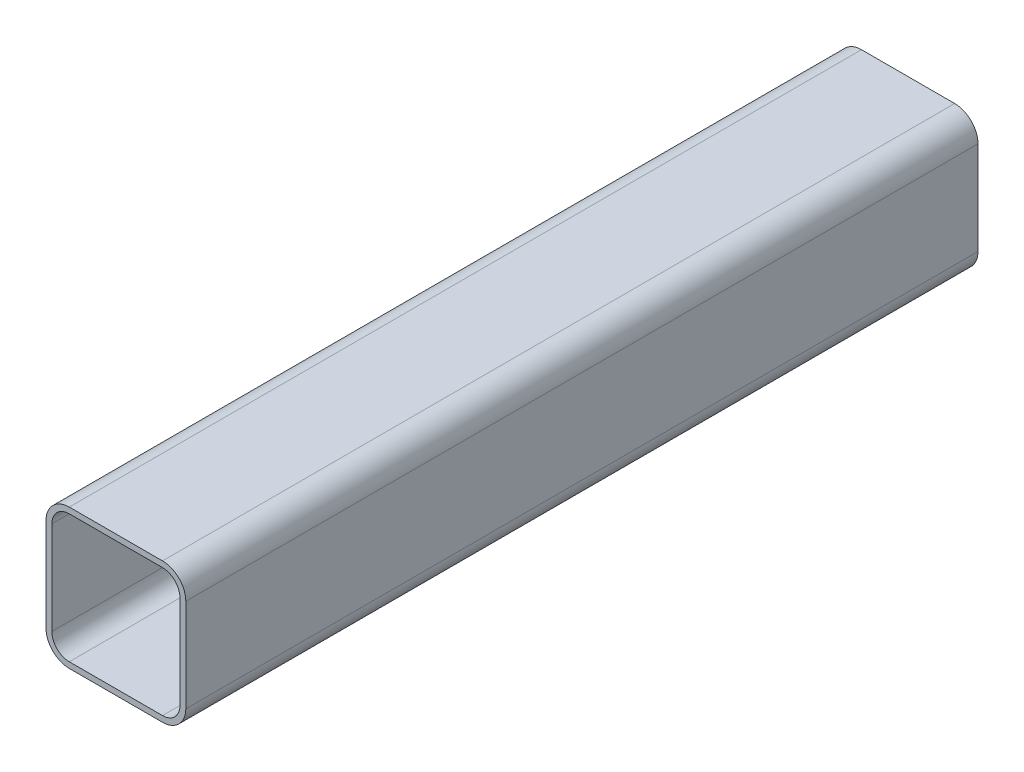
from build123d import *

# Parameters (mm, degrees)
BASE_EXTRUDE_THIN_DEPTH = 431.8


with BuildPart() as part:
    # Sketch1 → Base-Extrude-Thin (new body)
    with BuildSketch(Plane.XY):
        with BuildLine():
            Line((-25.4, 38.1), (25.4, 38.1))
            ThreePointArc((25.4, 38.1), (34.380256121, 34.380256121), (38.1, 25.4))
            Line((38.1, 25.4), (38.1, -25.4))
            ThreePointArc((38.1, -25.4), (34.380256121, -34.380256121), (25.4, -38.1))
            Line((25.4, -38.1), (-25.4, -38.1))
            ThreePointArc((-25.4, -38.1), (-34.380256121, -34.380256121), (-38.1, -25.4))
            Line((-38.1, -25.4), (-38.1, 25.4))
            ThreePointArc((-38.1, 25.4), (-34.380256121, 34.380256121), (-25.4, 38.1))
        make_face()
        with BuildLine():
            Line((-25.4, 34.925), (25.4, 34.925))
            ThreePointArc((25.4, 34.925), (32.135192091, 32.135192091), (34.925, 25.4))
            Line((34.925, 25.4), (34.925, -25.4))
            ThreePointArc((34.925, -25.4), (32.135192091, -32.135192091), (25.4, -34.925))
            Line((25.4, -34.925), (-25.4, -34.925))
            ThreePointArc((-25.4, -34.925), (-32.135192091, -32.135192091), (-34.925, -25.4))
            Line((-34.925, -25.4), (-34.925, 25.4))
            ThreePointArc((-34.925, 25.4), (-32.135192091, 32.135192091), (-25.4, 34.925))
        make_face(mode=Mode.SUBTRACT)
    extrude(amount=BASE_EXTRUDE_THIN_DEPTH)


solid = part.part
